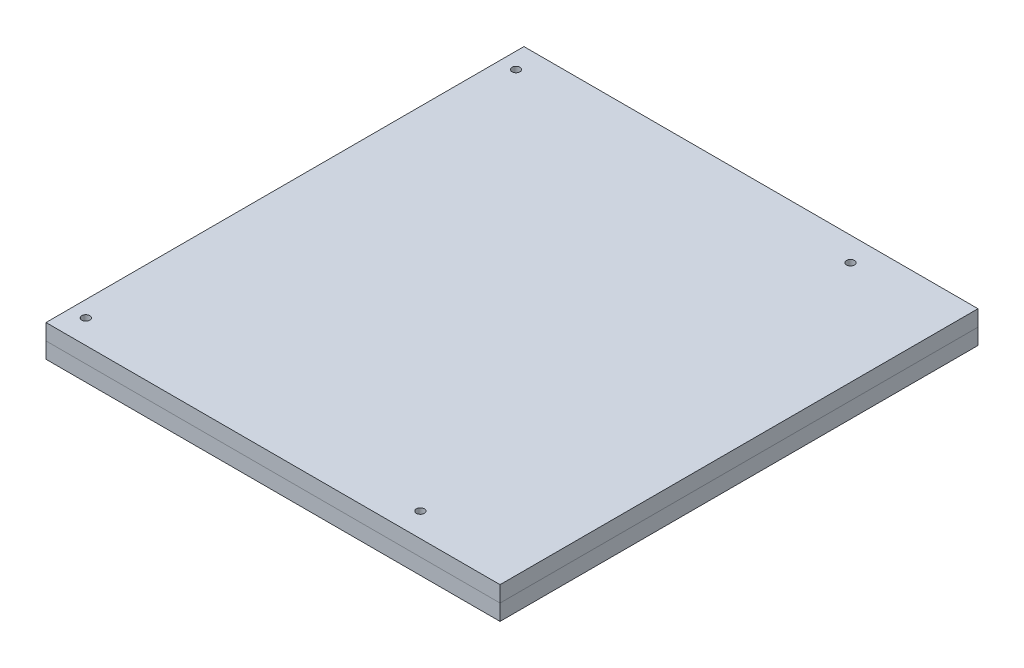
ISO-10303-21;
HEADER;
FILE_DESCRIPTION(('STEP AP214'),'2;1');
FILE_NAME('part.step','',(''),(''),'','','');
FILE_SCHEMA(('AUTOMOTIVE_DESIGN { 1 0 10303 214 1 1 1 1 }'));
ENDSEC;
DATA;
#1=APPLICATION_CONTEXT('core data for automotive mechanical design processes');
#2=APPLICATION_PROTOCOL_DEFINITION('international standard','automotive_design',2000,#1);
#3=PRODUCT_CONTEXT('',#1,'mechanical');
#4=PRODUCT('Part','Part','',(#3));
#5=PRODUCT_RELATED_PRODUCT_CATEGORY('part','',(#4));
#6=PRODUCT_DEFINITION_FORMATION('','',#4);
#7=PRODUCT_DEFINITION_CONTEXT('part definition',#1,'design');
#8=PRODUCT_DEFINITION('design','',#6,#7);
#9=PRODUCT_DEFINITION_SHAPE('','',#8);
#10=(LENGTH_UNIT() NAMED_UNIT(*) SI_UNIT(.MILLI.,.METRE.));
#11=(NAMED_UNIT(*) PLANE_ANGLE_UNIT() SI_UNIT($,.RADIAN.));
#12=(NAMED_UNIT(*) SI_UNIT($,.STERADIAN.) SOLID_ANGLE_UNIT());
#13=UNCERTAINTY_MEASURE_WITH_UNIT(LENGTH_MEASURE(1.E-05),#10,'distance_accuracy_value','');
#14=(GEOMETRIC_REPRESENTATION_CONTEXT(3) GLOBAL_UNCERTAINTY_ASSIGNED_CONTEXT((#13)) GLOBAL_UNIT_ASSIGNED_CONTEXT((#10,
#11,#12)) REPRESENTATION_CONTEXT('',''));
#15=CARTESIAN_POINT('',(0.,0.,0.));
#16=DIRECTION('',(0.,0.,1.));
#17=DIRECTION('',(1.,0.,0.));
#18=AXIS2_PLACEMENT_3D('',#15,#16,#17);
#19=CARTESIAN_POINT('',(0.,12.,0.));
#20=DIRECTION('',(1.,0.,0.));
#21=DIRECTION('',(0.,0.,-1.));
#22=AXIS2_PLACEMENT_3D('',#19,#20,#21);
#23=PLANE('',#22);
#24=DIRECTION('',(0.,0.,1.));
#25=VECTOR('',#24,1.);
#26=CARTESIAN_POINT('',(0.,6.,0.));
#27=LINE('',#26,#25);
#28=CARTESIAN_POINT('',(0.,6.,0.));
#29=VERTEX_POINT('',#28);
#30=CARTESIAN_POINT('',(0.,6.,180.));
#31=VERTEX_POINT('',#30);
#32=EDGE_CURVE('E112',#29,#31,#27,.T.);
#33=ORIENTED_EDGE('',*,*,#32,.T.);
#34=DIRECTION('',(0.,-1.,0.));
#35=VECTOR('',#34,1.);
#36=CARTESIAN_POINT('',(0.,12.,180.));
#37=LINE('',#36,#35);
#38=CARTESIAN_POINT('',(0.,12.,180.));
#39=VERTEX_POINT('',#38);
#40=EDGE_CURVE('E12',#39,#31,#37,.T.);
#41=ORIENTED_EDGE('',*,*,#40,.F.);
#42=DIRECTION('',(0.,0.,1.));
#43=VECTOR('',#42,1.);
#44=CARTESIAN_POINT('',(0.,12.,0.));
#45=LINE('',#44,#43);
#46=CARTESIAN_POINT('',(0.,12.,0.));
#47=VERTEX_POINT('',#46);
#48=EDGE_CURVE('E99',#47,#39,#45,.T.);
#49=ORIENTED_EDGE('',*,*,#48,.F.);
#50=DIRECTION('',(0.,-1.,0.));
#51=VECTOR('',#50,1.);
#52=CARTESIAN_POINT('',(0.,12.,0.));
#53=LINE('',#52,#51);
#54=EDGE_CURVE('E108',#47,#29,#53,.T.);
#55=ORIENTED_EDGE('',*,*,#54,.T.);
#56=EDGE_LOOP('',(#33,#41,#49,#55));
#57=FACE_BOUND('',#56,.T.);
#58=ADVANCED_FACE('F46',(#57),#23,.F.);
#59=CARTESIAN_POINT('',(0.,12.,180.));
#60=DIRECTION('',(0.,0.,-1.));
#61=DIRECTION('',(-1.,0.,0.));
#62=AXIS2_PLACEMENT_3D('',#59,#60,#61);
#63=PLANE('',#62);
#64=DIRECTION('',(1.,0.,0.));
#65=VECTOR('',#64,1.);
#66=CARTESIAN_POINT('',(0.,6.,180.));
#67=LINE('',#66,#65);
#68=CARTESIAN_POINT('',(171.,6.,180.));
#69=VERTEX_POINT('',#68);
#70=EDGE_CURVE('E103',#31,#69,#67,.T.);
#71=ORIENTED_EDGE('',*,*,#70,.T.);
#72=DIRECTION('',(0.,-1.,0.));
#73=VECTOR('',#72,1.);
#74=CARTESIAN_POINT('',(171.,12.,180.));
#75=LINE('',#74,#73);
#76=CARTESIAN_POINT('',(171.,12.,180.));
#77=VERTEX_POINT('',#76);
#78=EDGE_CURVE('E55',#77,#69,#75,.T.);
#79=ORIENTED_EDGE('',*,*,#78,.F.);
#80=DIRECTION('',(1.,0.,0.));
#81=VECTOR('',#80,1.);
#82=CARTESIAN_POINT('',(0.,12.,180.));
#83=LINE('',#82,#81);
#84=EDGE_CURVE('E94',#39,#77,#83,.T.);
#85=ORIENTED_EDGE('',*,*,#84,.F.);
#86=ORIENTED_EDGE('',*,*,#40,.T.);
#87=EDGE_LOOP('',(#71,#79,#85,#86));
#88=FACE_BOUND('',#87,.T.);
#89=ADVANCED_FACE('F102',(#88),#63,.F.);
#90=CARTESIAN_POINT('',(171.,12.,0.));
#91=DIRECTION('',(-1.,0.,0.));
#92=DIRECTION('',(0.,0.,1.));
#93=AXIS2_PLACEMENT_3D('',#90,#91,#92);
#94=PLANE('',#93);
#95=DIRECTION('',(0.,0.,-1.));
#96=VECTOR('',#95,1.);
#97=CARTESIAN_POINT('',(171.,6.,0.));
#98=LINE('',#97,#96);
#99=CARTESIAN_POINT('',(171.,6.,0.));
#100=VERTEX_POINT('',#99);
#101=EDGE_CURVE('E81',#69,#100,#98,.T.);
#102=ORIENTED_EDGE('',*,*,#101,.T.);
#103=DIRECTION('',(0.,-1.,0.));
#104=VECTOR('',#103,1.);
#105=CARTESIAN_POINT('',(171.,12.,0.));
#106=LINE('',#105,#104);
#107=CARTESIAN_POINT('',(171.,12.,0.));
#108=VERTEX_POINT('',#107);
#109=EDGE_CURVE('E104',#108,#100,#106,.T.);
#110=ORIENTED_EDGE('',*,*,#109,.F.);
#111=DIRECTION('',(0.,0.,-1.));
#112=VECTOR('',#111,1.);
#113=CARTESIAN_POINT('',(171.,12.,0.));
#114=LINE('',#113,#112);
#115=EDGE_CURVE('E97',#77,#108,#114,.T.);
#116=ORIENTED_EDGE('',*,*,#115,.F.);
#117=ORIENTED_EDGE('',*,*,#78,.T.);
#118=EDGE_LOOP('',(#102,#110,#116,#117));
#119=FACE_BOUND('',#118,.T.);
#120=ADVANCED_FACE('F106',(#119),#94,.F.);
#121=CARTESIAN_POINT('',(0.,12.,0.));
#122=DIRECTION('',(0.,0.,1.));
#123=DIRECTION('',(1.,0.,0.));
#124=AXIS2_PLACEMENT_3D('',#121,#122,#123);
#125=PLANE('',#124);
#126=DIRECTION('',(-1.,0.,0.));
#127=VECTOR('',#126,1.);
#128=CARTESIAN_POINT('',(0.,6.,0.));
#129=LINE('',#128,#127);
#130=EDGE_CURVE('E87',#100,#29,#129,.T.);
#131=ORIENTED_EDGE('',*,*,#130,.T.);
#132=ORIENTED_EDGE('',*,*,#54,.F.);
#133=DIRECTION('',(-1.,0.,0.));
#134=VECTOR('',#133,1.);
#135=CARTESIAN_POINT('',(0.,12.,0.));
#136=LINE('',#135,#134);
#137=EDGE_CURVE('E64',#108,#47,#136,.T.);
#138=ORIENTED_EDGE('',*,*,#137,.F.);
#139=ORIENTED_EDGE('',*,*,#109,.T.);
#140=EDGE_LOOP('',(#131,#132,#138,#139));
#141=FACE_BOUND('',#140,.T.);
#142=ADVANCED_FACE('F163',(#141),#125,.F.);
#143=CARTESIAN_POINT('',(0.,12.,0.));
#144=DIRECTION('',(0.,1.,0.));
#145=DIRECTION('',(0.,0.,1.));
#146=AXIS2_PLACEMENT_3D('',#143,#144,#145);
#147=PLANE('',#146);
#148=CARTESIAN_POINT('',(6.,12.,9.));
#149=DIRECTION('',(0.,1.,0.));
#150=DIRECTION('',(0.,0.,1.));
#151=AXIS2_PLACEMENT_3D('',#148,#149,#150);
#152=CIRCLE('',#151,1.5);
#153=CARTESIAN_POINT('',(6.,12.,10.5));
#154=VERTEX_POINT('',#153);
#155=EDGE_CURVE('E124',#154,#154,#152,.T.);
#156=ORIENTED_EDGE('',*,*,#155,.F.);
#157=EDGE_LOOP('',(#156));
#158=FACE_BOUND('',#157,.T.);
#159=CARTESIAN_POINT('',(132.,12.,8.99999999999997));
#160=DIRECTION('',(0.,1.,0.));
#161=DIRECTION('',(0.,0.,-1.));
#162=AXIS2_PLACEMENT_3D('',#159,#160,#161);
#163=CIRCLE('',#162,1.5);
#164=CARTESIAN_POINT('',(132.,12.,7.49999999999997));
#165=VERTEX_POINT('',#164);
#166=EDGE_CURVE('E225',#165,#165,#163,.T.);
#167=ORIENTED_EDGE('',*,*,#166,.F.);
#168=EDGE_LOOP('',(#167));
#169=FACE_BOUND('',#168,.T.);
#170=CARTESIAN_POINT('',(132.,12.,171.));
#171=DIRECTION('',(0.,1.,0.));
#172=DIRECTION('',(0.,0.,1.));
#173=AXIS2_PLACEMENT_3D('',#170,#171,#172);
#174=CIRCLE('',#173,1.5);
#175=CARTESIAN_POINT('',(132.,12.,172.5));
#176=VERTEX_POINT('',#175);
#177=EDGE_CURVE('E218',#176,#176,#174,.T.);
#178=ORIENTED_EDGE('',*,*,#177,.F.);
#179=EDGE_LOOP('',(#178));
#180=FACE_BOUND('',#179,.T.);
#181=CARTESIAN_POINT('',(6.00000000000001,12.,171.));
#182=DIRECTION('',(0.,1.,0.));
#183=DIRECTION('',(0.,0.,-1.));
#184=AXIS2_PLACEMENT_3D('',#181,#182,#183);
#185=CIRCLE('',#184,1.49999999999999);
#186=CARTESIAN_POINT('',(6.00000000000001,12.,169.5));
#187=VERTEX_POINT('',#186);
#188=EDGE_CURVE('E226',#187,#187,#185,.T.);
#189=ORIENTED_EDGE('',*,*,#188,.F.);
#190=EDGE_LOOP('',(#189));
#191=FACE_BOUND('',#190,.T.);
#192=ORIENTED_EDGE('',*,*,#48,.T.);
#193=ORIENTED_EDGE('',*,*,#84,.T.);
#194=ORIENTED_EDGE('',*,*,#115,.T.);
#195=ORIENTED_EDGE('',*,*,#137,.T.);
#196=EDGE_LOOP('',(#192,#193,#194,#195));
#197=FACE_BOUND('',#196,.T.);
#198=ADVANCED_FACE('F95',(#158,#169,#180,#191,#197),#147,.T.);
#199=CARTESIAN_POINT('',(0.,6.,0.));
#200=DIRECTION('',(0.,1.,0.));
#201=DIRECTION('',(0.,0.,1.));
#202=AXIS2_PLACEMENT_3D('',#199,#200,#201);
#203=PLANE('',#202);
#204=CARTESIAN_POINT('',(6.,6.,9.));
#205=DIRECTION('',(0.,1.,0.));
#206=DIRECTION('',(0.,0.,1.));
#207=AXIS2_PLACEMENT_3D('',#204,#205,#206);
#208=CIRCLE('',#207,1.5);
#209=CARTESIAN_POINT('',(6.,6.,10.5));
#210=VERTEX_POINT('',#209);
#211=EDGE_CURVE('E49',#210,#210,#208,.T.);
#212=ORIENTED_EDGE('',*,*,#211,.T.);
#213=EDGE_LOOP('',(#212));
#214=FACE_BOUND('',#213,.T.);
#215=CARTESIAN_POINT('',(132.,6.,8.99999999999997));
#216=DIRECTION('',(0.,1.,0.));
#217=DIRECTION('',(0.,0.,1.));
#218=AXIS2_PLACEMENT_3D('',#215,#216,#217);
#219=CIRCLE('',#218,1.5);
#220=CARTESIAN_POINT('',(132.,6.,10.5));
#221=VERTEX_POINT('',#220);
#222=EDGE_CURVE('E126',#221,#221,#219,.T.);
#223=ORIENTED_EDGE('',*,*,#222,.T.);
#224=EDGE_LOOP('',(#223));
#225=FACE_BOUND('',#224,.T.);
#226=CARTESIAN_POINT('',(132.,6.,171.));
#227=DIRECTION('',(0.,1.,0.));
#228=DIRECTION('',(0.,0.,1.));
#229=AXIS2_PLACEMENT_3D('',#226,#227,#228);
#230=CIRCLE('',#229,1.5);
#231=CARTESIAN_POINT('',(132.,6.,172.5));
#232=VERTEX_POINT('',#231);
#233=EDGE_CURVE('E123',#232,#232,#230,.T.);
#234=ORIENTED_EDGE('',*,*,#233,.T.);
#235=EDGE_LOOP('',(#234));
#236=FACE_BOUND('',#235,.T.);
#237=CARTESIAN_POINT('',(6.00000000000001,6.,171.));
#238=DIRECTION('',(0.,1.,0.));
#239=DIRECTION('',(0.,0.,1.));
#240=AXIS2_PLACEMENT_3D('',#237,#238,#239);
#241=CIRCLE('',#240,1.49999999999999);
#242=CARTESIAN_POINT('',(6.00000000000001,6.,172.5));
#243=VERTEX_POINT('',#242);
#244=EDGE_CURVE('E120',#243,#243,#241,.T.);
#245=ORIENTED_EDGE('',*,*,#244,.T.);
#246=EDGE_LOOP('',(#245));
#247=FACE_BOUND('',#246,.T.);
#248=ORIENTED_EDGE('',*,*,#32,.F.);
#249=ORIENTED_EDGE('',*,*,#130,.F.);
#250=ORIENTED_EDGE('',*,*,#101,.F.);
#251=ORIENTED_EDGE('',*,*,#70,.F.);
#252=EDGE_LOOP('',(#248,#249,#250,#251));
#253=FACE_BOUND('',#252,.T.);
#254=ADVANCED_FACE('F133',(#214,#225,#236,#247,#253),#203,.F.);
#255=CARTESIAN_POINT('',(6.00000000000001,0.,171.));
#256=DIRECTION('',(0.,1.,0.));
#257=DIRECTION('',(0.,0.,1.));
#258=AXIS2_PLACEMENT_3D('',#255,#256,#257);
#259=CYLINDRICAL_SURFACE('',#258,1.49999999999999);
#260=ORIENTED_EDGE('',*,*,#188,.T.);
#261=EDGE_LOOP('',(#260));
#262=FACE_BOUND('',#261,.T.);
#263=ORIENTED_EDGE('',*,*,#244,.F.);
#264=EDGE_LOOP('',(#263));
#265=FACE_BOUND('',#264,.T.);
#266=ADVANCED_FACE('F155',(#262,#265),#259,.F.);
#267=CARTESIAN_POINT('',(132.,0.,171.));
#268=DIRECTION('',(0.,1.,0.));
#269=DIRECTION('',(0.,0.,1.));
#270=AXIS2_PLACEMENT_3D('',#267,#268,#269);
#271=CYLINDRICAL_SURFACE('',#270,1.5);
#272=ORIENTED_EDGE('',*,*,#177,.T.);
#273=EDGE_LOOP('',(#272));
#274=FACE_BOUND('',#273,.T.);
#275=ORIENTED_EDGE('',*,*,#233,.F.);
#276=EDGE_LOOP('',(#275));
#277=FACE_BOUND('',#276,.T.);
#278=ADVANCED_FACE('F143',(#274,#277),#271,.F.);
#279=CARTESIAN_POINT('',(132.,0.,8.99999999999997));
#280=DIRECTION('',(0.,1.,0.));
#281=DIRECTION('',(0.,0.,1.));
#282=AXIS2_PLACEMENT_3D('',#279,#280,#281);
#283=CYLINDRICAL_SURFACE('',#282,1.5);
#284=ORIENTED_EDGE('',*,*,#166,.T.);
#285=EDGE_LOOP('',(#284));
#286=FACE_BOUND('',#285,.T.);
#287=ORIENTED_EDGE('',*,*,#222,.F.);
#288=EDGE_LOOP('',(#287));
#289=FACE_BOUND('',#288,.T.);
#290=ADVANCED_FACE('F137',(#286,#289),#283,.F.);
#291=CARTESIAN_POINT('',(6.,0.,9.));
#292=DIRECTION('',(0.,1.,0.));
#293=DIRECTION('',(0.,0.,1.));
#294=AXIS2_PLACEMENT_3D('',#291,#292,#293);
#295=CYLINDRICAL_SURFACE('',#294,1.5);
#296=ORIENTED_EDGE('',*,*,#155,.T.);
#297=EDGE_LOOP('',(#296));
#298=FACE_BOUND('',#297,.T.);
#299=ORIENTED_EDGE('',*,*,#211,.F.);
#300=EDGE_LOOP('',(#299));
#301=FACE_BOUND('',#300,.T.);
#302=ADVANCED_FACE('F135',(#298,#301),#295,.F.);
#303=CLOSED_SHELL('',(#58,#89,#120,#142,#198,#254,#266,#278,#290,#302));
#304=MANIFOLD_SOLID_BREP('B2',#303);
#305=CARTESIAN_POINT('',(0.,6.,0.));
#306=DIRECTION('',(1.,0.,0.));
#307=DIRECTION('',(0.,0.,-1.));
#308=AXIS2_PLACEMENT_3D('',#305,#306,#307);
#309=PLANE('',#308);
#310=DIRECTION('',(0.,0.,1.));
#311=VECTOR('',#310,1.);
#312=CARTESIAN_POINT('',(0.,0.,0.));
#313=LINE('',#312,#311);
#314=CARTESIAN_POINT('',(0.,0.,0.));
#315=VERTEX_POINT('',#314);
#316=CARTESIAN_POINT('',(0.,0.,180.));
#317=VERTEX_POINT('',#316);
#318=EDGE_CURVE('E316',#315,#317,#313,.T.);
#319=ORIENTED_EDGE('',*,*,#318,.T.);
#320=DIRECTION('',(0.,-1.,0.));
#321=VECTOR('',#320,1.);
#322=CARTESIAN_POINT('',(0.,6.,180.));
#323=LINE('',#322,#321);
#324=CARTESIAN_POINT('',(0.,6.,180.));
#325=VERTEX_POINT('',#324);
#326=EDGE_CURVE('E44',#325,#317,#323,.T.);
#327=ORIENTED_EDGE('',*,*,#326,.F.);
#328=DIRECTION('',(0.,0.,1.));
#329=VECTOR('',#328,1.);
#330=CARTESIAN_POINT('',(0.,6.,0.));
#331=LINE('',#330,#329);
#332=CARTESIAN_POINT('',(0.,6.,0.));
#333=VERTEX_POINT('',#332);
#334=EDGE_CURVE('E304',#333,#325,#331,.T.);
#335=ORIENTED_EDGE('',*,*,#334,.F.);
#336=DIRECTION('',(0.,-1.,0.));
#337=VECTOR('',#336,1.);
#338=CARTESIAN_POINT('',(0.,6.,0.));
#339=LINE('',#338,#337);
#340=EDGE_CURVE('E312',#333,#315,#339,.T.);
#341=ORIENTED_EDGE('',*,*,#340,.T.);
#342=EDGE_LOOP('',(#319,#327,#335,#341));
#343=FACE_BOUND('',#342,.T.);
#344=ADVANCED_FACE('F253',(#343),#309,.F.);
#345=CARTESIAN_POINT('',(0.,6.,180.));
#346=DIRECTION('',(0.,0.,-1.));
#347=DIRECTION('',(-1.,0.,0.));
#348=AXIS2_PLACEMENT_3D('',#345,#346,#347);
#349=PLANE('',#348);
#350=DIRECTION('',(1.,0.,0.));
#351=VECTOR('',#350,1.);
#352=CARTESIAN_POINT('',(0.,0.,180.));
#353=LINE('',#352,#351);
#354=CARTESIAN_POINT('',(171.,0.,180.));
#355=VERTEX_POINT('',#354);
#356=EDGE_CURVE('E308',#317,#355,#353,.T.);
#357=ORIENTED_EDGE('',*,*,#356,.T.);
#358=DIRECTION('',(0.,-1.,0.));
#359=VECTOR('',#358,1.);
#360=CARTESIAN_POINT('',(171.,6.,180.));
#361=LINE('',#360,#359);
#362=CARTESIAN_POINT('',(171.,6.,180.));
#363=VERTEX_POINT('',#362);
#364=EDGE_CURVE('E261',#363,#355,#361,.T.);
#365=ORIENTED_EDGE('',*,*,#364,.F.);
#366=DIRECTION('',(1.,0.,0.));
#367=VECTOR('',#366,1.);
#368=CARTESIAN_POINT('',(0.,6.,180.));
#369=LINE('',#368,#367);
#370=EDGE_CURVE('E299',#325,#363,#369,.T.);
#371=ORIENTED_EDGE('',*,*,#370,.F.);
#372=ORIENTED_EDGE('',*,*,#326,.T.);
#373=EDGE_LOOP('',(#357,#365,#371,#372));
#374=FACE_BOUND('',#373,.T.);
#375=ADVANCED_FACE('F307',(#374),#349,.F.);
#376=CARTESIAN_POINT('',(171.,6.,0.));
#377=DIRECTION('',(-1.,0.,0.));
#378=DIRECTION('',(0.,0.,1.));
#379=AXIS2_PLACEMENT_3D('',#376,#377,#378);
#380=PLANE('',#379);
#381=DIRECTION('',(0.,0.,-1.));
#382=VECTOR('',#381,1.);
#383=CARTESIAN_POINT('',(171.,0.,0.));
#384=LINE('',#383,#382);
#385=CARTESIAN_POINT('',(171.,0.,0.));
#386=VERTEX_POINT('',#385);
#387=EDGE_CURVE('E286',#355,#386,#384,.T.);
#388=ORIENTED_EDGE('',*,*,#387,.T.);
#389=DIRECTION('',(0.,-1.,0.));
#390=VECTOR('',#389,1.);
#391=CARTESIAN_POINT('',(171.,6.,0.));
#392=LINE('',#391,#390);
#393=CARTESIAN_POINT('',(171.,6.,0.));
#394=VERTEX_POINT('',#393);
#395=EDGE_CURVE('E309',#394,#386,#392,.T.);
#396=ORIENTED_EDGE('',*,*,#395,.F.);
#397=DIRECTION('',(0.,0.,-1.));
#398=VECTOR('',#397,1.);
#399=CARTESIAN_POINT('',(171.,6.,0.));
#400=LINE('',#399,#398);
#401=EDGE_CURVE('E302',#363,#394,#400,.T.);
#402=ORIENTED_EDGE('',*,*,#401,.F.);
#403=ORIENTED_EDGE('',*,*,#364,.T.);
#404=EDGE_LOOP('',(#388,#396,#402,#403));
#405=FACE_BOUND('',#404,.T.);
#406=ADVANCED_FACE('F310',(#405),#380,.F.);
#407=CARTESIAN_POINT('',(0.,6.,0.));
#408=DIRECTION('',(0.,0.,1.));
#409=DIRECTION('',(1.,0.,0.));
#410=AXIS2_PLACEMENT_3D('',#407,#408,#409);
#411=PLANE('',#410);
#412=DIRECTION('',(-1.,0.,0.));
#413=VECTOR('',#412,1.);
#414=CARTESIAN_POINT('',(0.,0.,0.));
#415=LINE('',#414,#413);
#416=EDGE_CURVE('E292',#386,#315,#415,.T.);
#417=ORIENTED_EDGE('',*,*,#416,.T.);
#418=ORIENTED_EDGE('',*,*,#340,.F.);
#419=DIRECTION('',(-1.,0.,0.));
#420=VECTOR('',#419,1.);
#421=CARTESIAN_POINT('',(0.,6.,0.));
#422=LINE('',#421,#420);
#423=EDGE_CURVE('E269',#394,#333,#422,.T.);
#424=ORIENTED_EDGE('',*,*,#423,.F.);
#425=ORIENTED_EDGE('',*,*,#395,.T.);
#426=EDGE_LOOP('',(#417,#418,#424,#425));
#427=FACE_BOUND('',#426,.T.);
#428=ADVANCED_FACE('F324',(#427),#411,.F.);
#429=CARTESIAN_POINT('',(0.,6.,0.));
#430=DIRECTION('',(0.,1.,0.));
#431=DIRECTION('',(0.,0.,1.));
#432=AXIS2_PLACEMENT_3D('',#429,#430,#431);
#433=PLANE('',#432);
#434=CARTESIAN_POINT('',(6.,6.,9.));
#435=DIRECTION('',(0.,1.,0.));
#436=DIRECTION('',(0.,0.,1.));
#437=AXIS2_PLACEMENT_3D('',#434,#435,#436);
#438=CIRCLE('',#437,1.5);
#439=CARTESIAN_POINT('',(6.,6.,10.5));
#440=VERTEX_POINT('',#439);
#441=EDGE_CURVE('E319',#440,#440,#438,.T.);
#442=ORIENTED_EDGE('',*,*,#441,.F.);
#443=EDGE_LOOP('',(#442));
#444=FACE_BOUND('',#443,.T.);
#445=CARTESIAN_POINT('',(132.,6.,8.99999999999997));
#446=DIRECTION('',(0.,1.,0.));
#447=DIRECTION('',(0.,0.,1.));
#448=AXIS2_PLACEMENT_3D('',#445,#446,#447);
#449=CIRCLE('',#448,1.5);
#450=CARTESIAN_POINT('',(132.,6.,10.5));
#451=VERTEX_POINT('',#450);
#452=EDGE_CURVE('E332',#451,#451,#449,.T.);
#453=ORIENTED_EDGE('',*,*,#452,.F.);
#454=EDGE_LOOP('',(#453));
#455=FACE_BOUND('',#454,.T.);
#456=CARTESIAN_POINT('',(132.,6.,171.));
#457=DIRECTION('',(0.,1.,0.));
#458=DIRECTION('',(0.,0.,1.));
#459=AXIS2_PLACEMENT_3D('',#456,#457,#458);
#460=CIRCLE('',#459,1.5);
#461=CARTESIAN_POINT('',(132.,6.,172.5));
#462=VERTEX_POINT('',#461);
#463=EDGE_CURVE('E335',#462,#462,#460,.T.);
#464=ORIENTED_EDGE('',*,*,#463,.F.);
#465=EDGE_LOOP('',(#464));
#466=FACE_BOUND('',#465,.T.);
#467=CARTESIAN_POINT('',(6.00000000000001,6.,171.));
#468=DIRECTION('',(0.,1.,0.));
#469=DIRECTION('',(0.,0.,1.));
#470=AXIS2_PLACEMENT_3D('',#467,#468,#469);
#471=CIRCLE('',#470,1.49999999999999);
#472=CARTESIAN_POINT('',(6.00000000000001,6.,172.5));
#473=VERTEX_POINT('',#472);
#474=EDGE_CURVE('E338',#473,#473,#471,.T.);
#475=ORIENTED_EDGE('',*,*,#474,.F.);
#476=EDGE_LOOP('',(#475));
#477=FACE_BOUND('',#476,.T.);
#478=ORIENTED_EDGE('',*,*,#334,.T.);
#479=ORIENTED_EDGE('',*,*,#370,.T.);
#480=ORIENTED_EDGE('',*,*,#401,.T.);
#481=ORIENTED_EDGE('',*,*,#423,.T.);
#482=EDGE_LOOP('',(#478,#479,#480,#481));
#483=FACE_BOUND('',#482,.T.);
#484=ADVANCED_FACE('F300',(#444,#455,#466,#477,#483),#433,.T.);
#485=CARTESIAN_POINT('',(0.,0.,0.));
#486=DIRECTION('',(0.,1.,0.));
#487=DIRECTION('',(0.,0.,1.));
#488=AXIS2_PLACEMENT_3D('',#485,#486,#487);
#489=PLANE('',#488);
#490=CARTESIAN_POINT('',(6.,0.,9.));
#491=DIRECTION('',(0.,1.,0.));
#492=DIRECTION('',(0.,0.,1.));
#493=AXIS2_PLACEMENT_3D('',#490,#491,#492);
#494=CIRCLE('',#493,1.5);
#495=CARTESIAN_POINT('',(6.,0.,10.5));
#496=VERTEX_POINT('',#495);
#497=EDGE_CURVE('E341',#496,#496,#494,.T.);
#498=ORIENTED_EDGE('',*,*,#497,.T.);
#499=EDGE_LOOP('',(#498));
#500=FACE_BOUND('',#499,.T.);
#501=CARTESIAN_POINT('',(132.,0.,8.99999999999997));
#502=DIRECTION('',(0.,1.,0.));
#503=DIRECTION('',(0.,0.,-1.));
#504=AXIS2_PLACEMENT_3D('',#501,#502,#503);
#505=CIRCLE('',#504,1.5);
#506=CARTESIAN_POINT('',(132.,0.,7.49999999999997));
#507=VERTEX_POINT('',#506);
#508=EDGE_CURVE('E348',#507,#507,#505,.T.);
#509=ORIENTED_EDGE('',*,*,#508,.T.);
#510=EDGE_LOOP('',(#509));
#511=FACE_BOUND('',#510,.T.);
#512=CARTESIAN_POINT('',(132.,0.,171.));
#513=DIRECTION('',(0.,1.,0.));
#514=DIRECTION('',(0.,0.,1.));
#515=AXIS2_PLACEMENT_3D('',#512,#513,#514);
#516=CIRCLE('',#515,1.5);
#517=CARTESIAN_POINT('',(132.,0.,172.5));
#518=VERTEX_POINT('',#517);
#519=EDGE_CURVE('E345',#518,#518,#516,.T.);
#520=ORIENTED_EDGE('',*,*,#519,.T.);
#521=EDGE_LOOP('',(#520));
#522=FACE_BOUND('',#521,.T.);
#523=CARTESIAN_POINT('',(6.00000000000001,0.,171.));
#524=DIRECTION('',(0.,1.,0.));
#525=DIRECTION('',(0.,0.,-1.));
#526=AXIS2_PLACEMENT_3D('',#523,#524,#525);
#527=CIRCLE('',#526,1.49999999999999);
#528=CARTESIAN_POINT('',(6.00000000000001,0.,169.5));
#529=VERTEX_POINT('',#528);
#530=EDGE_CURVE('E342',#529,#529,#527,.T.);
#531=ORIENTED_EDGE('',*,*,#530,.T.);
#532=EDGE_LOOP('',(#531));
#533=FACE_BOUND('',#532,.T.);
#534=ORIENTED_EDGE('',*,*,#318,.F.);
#535=ORIENTED_EDGE('',*,*,#416,.F.);
#536=ORIENTED_EDGE('',*,*,#387,.F.);
#537=ORIENTED_EDGE('',*,*,#356,.F.);
#538=EDGE_LOOP('',(#534,#535,#536,#537));
#539=FACE_BOUND('',#538,.T.);
#540=ADVANCED_FACE('F327',(#500,#511,#522,#533,#539),#489,.F.);
#541=CARTESIAN_POINT('',(6.00000000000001,0.,171.));
#542=DIRECTION('',(0.,1.,0.));
#543=DIRECTION('',(0.,0.,1.));
#544=AXIS2_PLACEMENT_3D('',#541,#542,#543);
#545=CYLINDRICAL_SURFACE('',#544,1.49999999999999);
#546=ORIENTED_EDGE('',*,*,#474,.T.);
#547=EDGE_LOOP('',(#546));
#548=FACE_BOUND('',#547,.T.);
#549=ORIENTED_EDGE('',*,*,#530,.F.);
#550=EDGE_LOOP('',(#549));
#551=FACE_BOUND('',#550,.T.);
#552=ADVANCED_FACE('F380',(#548,#551),#545,.F.);
#553=CARTESIAN_POINT('',(132.,0.,171.));
#554=DIRECTION('',(0.,1.,0.));
#555=DIRECTION('',(0.,0.,1.));
#556=AXIS2_PLACEMENT_3D('',#553,#554,#555);
#557=CYLINDRICAL_SURFACE('',#556,1.5);
#558=ORIENTED_EDGE('',*,*,#463,.T.);
#559=EDGE_LOOP('',(#558));
#560=FACE_BOUND('',#559,.T.);
#561=ORIENTED_EDGE('',*,*,#519,.F.);
#562=EDGE_LOOP('',(#561));
#563=FACE_BOUND('',#562,.T.);
#564=ADVANCED_FACE('F364',(#560,#563),#557,.F.);
#565=CARTESIAN_POINT('',(132.,0.,8.99999999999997));
#566=DIRECTION('',(0.,1.,0.));
#567=DIRECTION('',(0.,0.,1.));
#568=AXIS2_PLACEMENT_3D('',#565,#566,#567);
#569=CYLINDRICAL_SURFACE('',#568,1.5);
#570=ORIENTED_EDGE('',*,*,#452,.T.);
#571=EDGE_LOOP('',(#570));
#572=FACE_BOUND('',#571,.T.);
#573=ORIENTED_EDGE('',*,*,#508,.F.);
#574=EDGE_LOOP('',(#573));
#575=FACE_BOUND('',#574,.T.);
#576=ADVANCED_FACE('F358',(#572,#575),#569,.F.);
#577=CARTESIAN_POINT('',(6.,0.,9.));
#578=DIRECTION('',(0.,1.,0.));
#579=DIRECTION('',(0.,0.,1.));
#580=AXIS2_PLACEMENT_3D('',#577,#578,#579);
#581=CYLINDRICAL_SURFACE('',#580,1.5);
#582=ORIENTED_EDGE('',*,*,#441,.T.);
#583=EDGE_LOOP('',(#582));
#584=FACE_BOUND('',#583,.T.);
#585=ORIENTED_EDGE('',*,*,#497,.F.);
#586=EDGE_LOOP('',(#585));
#587=FACE_BOUND('',#586,.T.);
#588=ADVANCED_FACE('F356',(#584,#587),#581,.F.);
#589=CLOSED_SHELL('',(#344,#375,#406,#428,#484,#540,#552,#564,#576,#588));
#590=MANIFOLD_SOLID_BREP('B6',#589);
#591=ADVANCED_BREP_SHAPE_REPRESENTATION('',(#18,#304,#590),#14);
#592=SHAPE_DEFINITION_REPRESENTATION(#9,#591);
ENDSEC;
END-ISO-10303-21;
